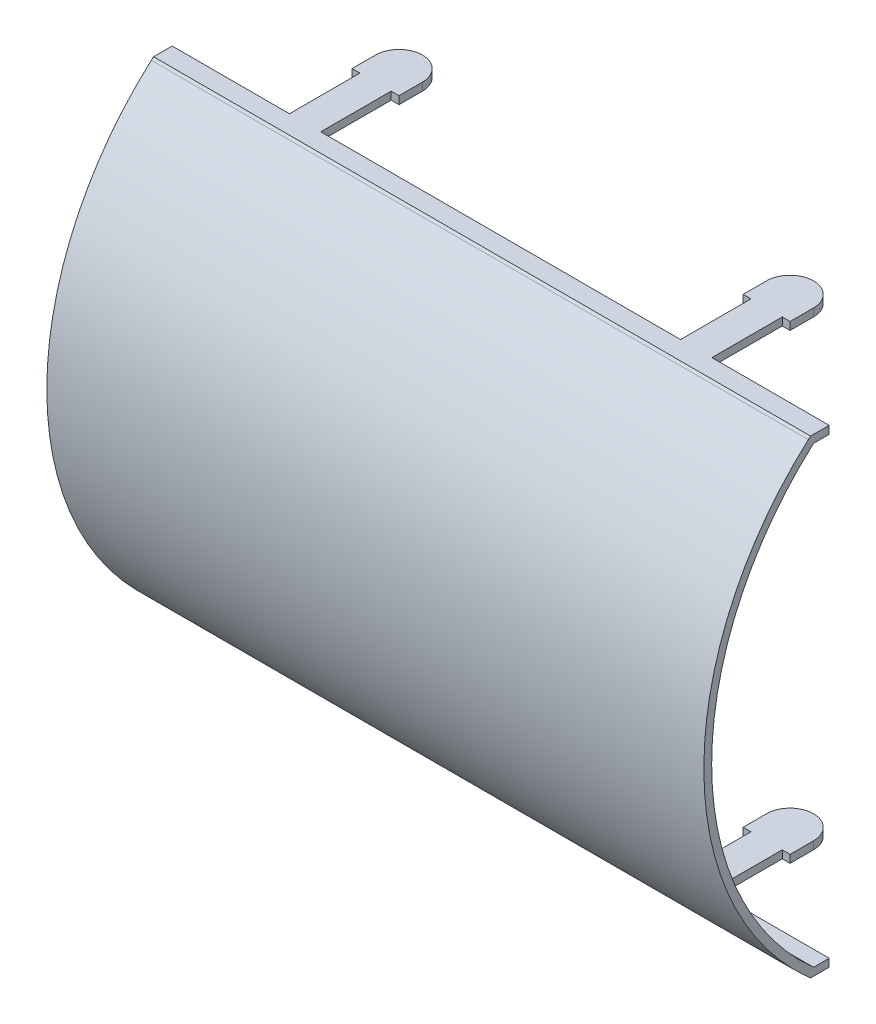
ISO-10303-21;
HEADER;
FILE_DESCRIPTION(('STEP AP214'),'2;1');
FILE_NAME('part.step','',(''),(''),'','','');
FILE_SCHEMA(('AUTOMOTIVE_DESIGN { 1 0 10303 214 1 1 1 1 }'));
ENDSEC;
DATA;
#1=APPLICATION_CONTEXT('core data for automotive mechanical design processes');
#2=APPLICATION_PROTOCOL_DEFINITION('international standard','automotive_design',2000,#1);
#3=PRODUCT_CONTEXT('',#1,'mechanical');
#4=PRODUCT('Part','Part','',(#3));
#5=PRODUCT_RELATED_PRODUCT_CATEGORY('part','',(#4));
#6=PRODUCT_DEFINITION_FORMATION('','',#4);
#7=PRODUCT_DEFINITION_CONTEXT('part definition',#1,'design');
#8=PRODUCT_DEFINITION('design','',#6,#7);
#9=PRODUCT_DEFINITION_SHAPE('','',#8);
#10=(LENGTH_UNIT() NAMED_UNIT(*) SI_UNIT(.MILLI.,.METRE.));
#11=(NAMED_UNIT(*) PLANE_ANGLE_UNIT() SI_UNIT($,.RADIAN.));
#12=(NAMED_UNIT(*) SI_UNIT($,.STERADIAN.) SOLID_ANGLE_UNIT());
#13=UNCERTAINTY_MEASURE_WITH_UNIT(LENGTH_MEASURE(1.E-05),#10,'distance_accuracy_value','');
#14=(GEOMETRIC_REPRESENTATION_CONTEXT(3) GLOBAL_UNCERTAINTY_ASSIGNED_CONTEXT((#13)) GLOBAL_UNIT_ASSIGNED_CONTEXT((#10,
#11,#12)) REPRESENTATION_CONTEXT('',''));
#15=CARTESIAN_POINT('',(0.,0.,0.));
#16=DIRECTION('',(0.,0.,1.));
#17=DIRECTION('',(1.,0.,0.));
#18=AXIS2_PLACEMENT_3D('',#15,#16,#17);
#19=CARTESIAN_POINT('',(11.5,15.00000003,11.8883668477));
#20=DIRECTION('',(0.,0.,1.));
#21=DIRECTION('',(1.,0.,0.));
#22=AXIS2_PLACEMENT_3D('',#19,#20,#21);
#23=PLANE('',#22);
#24=DIRECTION('',(1.,0.,0.));
#25=VECTOR('',#24,1.);
#26=CARTESIAN_POINT('',(0.,-15.,11.8883668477));
#27=LINE('',#26,#25);
#28=CARTESIAN_POINT('',(21.,-15.,11.8883668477));
#29=VERTEX_POINT('',#28);
#30=CARTESIAN_POINT('',(13.5,-15.,11.8883668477));
#31=VERTEX_POINT('',#30);
#32=EDGE_CURVE('E372',#29,#31,#27,.F.);
#33=ORIENTED_EDGE('',*,*,#32,.T.);
#34=DIRECTION('',(0.,1.,0.));
#35=VECTOR('',#34,1.);
#36=CARTESIAN_POINT('',(13.5,15.00000003,11.8883668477));
#37=LINE('',#36,#35);
#38=CARTESIAN_POINT('',(13.5,-14.5,11.8883668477));
#39=VERTEX_POINT('',#38);
#40=EDGE_CURVE('E368',#31,#39,#37,.T.);
#41=ORIENTED_EDGE('',*,*,#40,.T.);
#42=DIRECTION('',(1.,0.,0.));
#43=VECTOR('',#42,1.);
#44=CARTESIAN_POINT('',(0.,-14.5,11.8883668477));
#45=LINE('',#44,#43);
#46=CARTESIAN_POINT('',(21.,-14.5,11.8883668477));
#47=VERTEX_POINT('',#46);
#48=EDGE_CURVE('E276',#47,#39,#45,.F.);
#49=ORIENTED_EDGE('',*,*,#48,.F.);
#50=DIRECTION('',(0.,1.,0.));
#51=VECTOR('',#50,1.);
#52=CARTESIAN_POINT('',(21.,15.00000003,11.8883668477));
#53=LINE('',#52,#51);
#54=EDGE_CURVE('E376',#29,#47,#53,.T.);
#55=ORIENTED_EDGE('',*,*,#54,.F.);
#56=EDGE_LOOP('',(#33,#41,#49,#55));
#57=FACE_BOUND('',#56,.T.);
#58=ADVANCED_FACE('F16',(#57),#23,.F.);
#59=CARTESIAN_POINT('',(13.5,15.00000003,11.8883668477));
#60=DIRECTION('',(-1.,0.,0.));
#61=DIRECTION('',(0.,0.,1.));
#62=AXIS2_PLACEMENT_3D('',#59,#60,#61);
#63=PLANE('',#62);
#64=DIRECTION('',(0.,0.,1.));
#65=VECTOR('',#64,1.);
#66=CARTESIAN_POINT('',(13.5,-15.,13.0784607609));
#67=LINE('',#66,#65);
#68=CARTESIAN_POINT('',(13.5,-15.,7.38836684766));
#69=VERTEX_POINT('',#68);
#70=EDGE_CURVE('E364',#31,#69,#67,.F.);
#71=ORIENTED_EDGE('',*,*,#70,.T.);
#72=DIRECTION('',(0.,1.,0.));
#73=VECTOR('',#72,1.);
#74=CARTESIAN_POINT('',(13.5,15.00000003,7.38836684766));
#75=LINE('',#74,#73);
#76=CARTESIAN_POINT('',(13.5,-14.5,7.38836684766));
#77=VERTEX_POINT('',#76);
#78=EDGE_CURVE('E358',#69,#77,#75,.T.);
#79=ORIENTED_EDGE('',*,*,#78,.T.);
#80=DIRECTION('',(0.,0.,1.));
#81=VECTOR('',#80,1.);
#82=CARTESIAN_POINT('',(13.5,-14.5,12.8883668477));
#83=LINE('',#82,#81);
#84=EDGE_CURVE('E505',#39,#77,#83,.F.);
#85=ORIENTED_EDGE('',*,*,#84,.F.);
#86=ORIENTED_EDGE('',*,*,#40,.F.);
#87=EDGE_LOOP('',(#71,#79,#85,#86));
#88=FACE_BOUND('',#87,.T.);
#89=ADVANCED_FACE('F844',(#88),#63,.F.);
#90=CARTESIAN_POINT('',(11.,15.00000003,7.38836684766));
#91=DIRECTION('',(0.,0.,-1.));
#92=DIRECTION('',(-1.,0.,0.));
#93=AXIS2_PLACEMENT_3D('',#90,#91,#92);
#94=PLANE('',#93);
#95=DIRECTION('',(1.,0.,0.));
#96=VECTOR('',#95,1.);
#97=CARTESIAN_POINT('',(0.,-15.,7.38836684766));
#98=LINE('',#97,#96);
#99=CARTESIAN_POINT('',(14.,-15.,7.38836684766));
#100=VERTEX_POINT('',#99);
#101=EDGE_CURVE('E361',#69,#100,#98,.T.);
#102=ORIENTED_EDGE('',*,*,#101,.T.);
#103=DIRECTION('',(0.,1.,0.));
#104=VECTOR('',#103,1.);
#105=CARTESIAN_POINT('',(14.,15.00000003,7.38836684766));
#106=LINE('',#105,#104);
#107=CARTESIAN_POINT('',(14.,-14.5,7.38836684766));
#108=VERTEX_POINT('',#107);
#109=EDGE_CURVE('E135',#100,#108,#106,.T.);
#110=ORIENTED_EDGE('',*,*,#109,.T.);
#111=DIRECTION('',(1.,0.,0.));
#112=VECTOR('',#111,1.);
#113=CARTESIAN_POINT('',(0.,-14.5,7.38836684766));
#114=LINE('',#113,#112);
#115=EDGE_CURVE('E265',#77,#108,#114,.T.);
#116=ORIENTED_EDGE('',*,*,#115,.F.);
#117=ORIENTED_EDGE('',*,*,#78,.F.);
#118=EDGE_LOOP('',(#102,#110,#116,#117));
#119=FACE_BOUND('',#118,.T.);
#120=ADVANCED_FACE('F836',(#119),#94,.F.);
#121=CARTESIAN_POINT('',(14.,15.00000003,7.38836684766));
#122=DIRECTION('',(-1.,0.,0.));
#123=DIRECTION('',(0.,0.,1.));
#124=AXIS2_PLACEMENT_3D('',#121,#122,#123);
#125=PLANE('',#124);
#126=DIRECTION('',(0.,0.,1.));
#127=VECTOR('',#126,1.);
#128=CARTESIAN_POINT('',(14.,-15.,13.0784607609));
#129=LINE('',#128,#127);
#130=CARTESIAN_POINT('',(14.,-15.,5.88836684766));
#131=VERTEX_POINT('',#130);
#132=EDGE_CURVE('E363',#100,#131,#129,.F.);
#133=ORIENTED_EDGE('',*,*,#132,.T.);
#134=DIRECTION('',(0.,1.,0.));
#135=VECTOR('',#134,1.);
#136=CARTESIAN_POINT('',(14.,-0.659999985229,5.88836684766));
#137=LINE('',#136,#135);
#138=CARTESIAN_POINT('',(14.,-14.5,5.88836684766));
#139=VERTEX_POINT('',#138);
#140=EDGE_CURVE('E124',#139,#131,#137,.F.);
#141=ORIENTED_EDGE('',*,*,#140,.F.);
#142=DIRECTION('',(0.,0.,1.));
#143=VECTOR('',#142,1.);
#144=CARTESIAN_POINT('',(14.,-14.5,12.8883668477));
#145=LINE('',#144,#143);
#146=EDGE_CURVE('E257',#108,#139,#145,.F.);
#147=ORIENTED_EDGE('',*,*,#146,.F.);
#148=ORIENTED_EDGE('',*,*,#109,.F.);
#149=EDGE_LOOP('',(#133,#141,#147,#148));
#150=FACE_BOUND('',#149,.T.);
#151=ADVANCED_FACE('F834',(#150),#125,.F.);
#152=CARTESIAN_POINT('',(12.5,-0.659999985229,5.88836684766));
#153=DIRECTION('',(0.,1.,0.));
#154=DIRECTION('',(0.,0.,1.));
#155=AXIS2_PLACEMENT_3D('',#152,#153,#154);
#156=CYLINDRICAL_SURFACE('',#155,1.5);
#157=CARTESIAN_POINT('',(12.5,-15.,5.88836684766));
#158=DIRECTION('',(0.,1.,0.));
#159=DIRECTION('',(0.,0.,1.));
#160=AXIS2_PLACEMENT_3D('',#157,#158,#159);
#161=CIRCLE('',#160,1.5);
#162=CARTESIAN_POINT('',(11.,-15.,5.88836684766));
#163=VERTEX_POINT('',#162);
#164=EDGE_CURVE('E554',#131,#163,#161,.T.);
#165=ORIENTED_EDGE('',*,*,#164,.T.);
#166=DIRECTION('',(0.,1.,0.));
#167=VECTOR('',#166,1.);
#168=CARTESIAN_POINT('',(11.,15.00000003,5.88836684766));
#169=LINE('',#168,#167);
#170=CARTESIAN_POINT('',(11.,-14.5,5.88836684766));
#171=VERTEX_POINT('',#170);
#172=EDGE_CURVE('E242',#163,#171,#169,.T.);
#173=ORIENTED_EDGE('',*,*,#172,.T.);
#174=CARTESIAN_POINT('',(12.5,-14.5,5.88836684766));
#175=DIRECTION('',(0.,1.,0.));
#176=DIRECTION('',(0.,0.,1.));
#177=AXIS2_PLACEMENT_3D('',#174,#175,#176);
#178=CIRCLE('',#177,1.5);
#179=EDGE_CURVE('E19',#139,#171,#178,.T.);
#180=ORIENTED_EDGE('',*,*,#179,.F.);
#181=ORIENTED_EDGE('',*,*,#140,.T.);
#182=EDGE_LOOP('',(#165,#173,#180,#181));
#183=FACE_BOUND('',#182,.T.);
#184=ADVANCED_FACE('F833',(#183),#156,.T.);
#185=CARTESIAN_POINT('',(11.,15.00000003,5.88836684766));
#186=DIRECTION('',(1.,0.,0.));
#187=DIRECTION('',(0.,0.,-1.));
#188=AXIS2_PLACEMENT_3D('',#185,#186,#187);
#189=PLANE('',#188);
#190=DIRECTION('',(0.,0.,1.));
#191=VECTOR('',#190,1.);
#192=CARTESIAN_POINT('',(11.,-15.,13.0784607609));
#193=LINE('',#192,#191);
#194=CARTESIAN_POINT('',(11.,-15.,7.38836684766));
#195=VERTEX_POINT('',#194);
#196=EDGE_CURVE('E238',#163,#195,#193,.T.);
#197=ORIENTED_EDGE('',*,*,#196,.T.);
#198=DIRECTION('',(0.,1.,0.));
#199=VECTOR('',#198,1.);
#200=CARTESIAN_POINT('',(11.,15.00000003,7.38836684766));
#201=LINE('',#200,#199);
#202=CARTESIAN_POINT('',(11.,-14.5,7.38836684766));
#203=VERTEX_POINT('',#202);
#204=EDGE_CURVE('E230',#195,#203,#201,.T.);
#205=ORIENTED_EDGE('',*,*,#204,.T.);
#206=DIRECTION('',(0.,0.,1.));
#207=VECTOR('',#206,1.);
#208=CARTESIAN_POINT('',(11.,-14.5,12.8883668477));
#209=LINE('',#208,#207);
#210=EDGE_CURVE('E235',#171,#203,#209,.T.);
#211=ORIENTED_EDGE('',*,*,#210,.F.);
#212=ORIENTED_EDGE('',*,*,#172,.F.);
#213=EDGE_LOOP('',(#197,#205,#211,#212));
#214=FACE_BOUND('',#213,.T.);
#215=ADVANCED_FACE('F232',(#214),#189,.F.);
#216=CARTESIAN_POINT('',(11.,15.00000003,7.38836684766));
#217=DIRECTION('',(0.,0.,-1.));
#218=DIRECTION('',(-1.,0.,0.));
#219=AXIS2_PLACEMENT_3D('',#216,#217,#218);
#220=PLANE('',#219);
#221=DIRECTION('',(1.,0.,0.));
#222=VECTOR('',#221,1.);
#223=CARTESIAN_POINT('',(0.,-15.,7.38836684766));
#224=LINE('',#223,#222);
#225=CARTESIAN_POINT('',(11.5,-15.,7.38836684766));
#226=VERTEX_POINT('',#225);
#227=EDGE_CURVE('E344',#195,#226,#224,.T.);
#228=ORIENTED_EDGE('',*,*,#227,.T.);
#229=DIRECTION('',(0.,1.,0.));
#230=VECTOR('',#229,1.);
#231=CARTESIAN_POINT('',(11.5,15.00000003,7.38836684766));
#232=LINE('',#231,#230);
#233=CARTESIAN_POINT('',(11.5,-14.5,7.38836684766));
#234=VERTEX_POINT('',#233);
#235=EDGE_CURVE('E241',#226,#234,#232,.T.);
#236=ORIENTED_EDGE('',*,*,#235,.T.);
#237=DIRECTION('',(1.,0.,0.));
#238=VECTOR('',#237,1.);
#239=CARTESIAN_POINT('',(0.,-14.5,7.38836684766));
#240=LINE('',#239,#238);
#241=EDGE_CURVE('E245',#203,#234,#240,.T.);
#242=ORIENTED_EDGE('',*,*,#241,.F.);
#243=ORIENTED_EDGE('',*,*,#204,.F.);
#244=EDGE_LOOP('',(#228,#236,#242,#243));
#245=FACE_BOUND('',#244,.T.);
#246=ADVANCED_FACE('F246',(#245),#220,.F.);
#247=CARTESIAN_POINT('',(11.5,15.00000003,7.38836684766));
#248=DIRECTION('',(1.,0.,0.));
#249=DIRECTION('',(0.,0.,-1.));
#250=AXIS2_PLACEMENT_3D('',#247,#248,#249);
#251=PLANE('',#250);
#252=DIRECTION('',(0.,0.,1.));
#253=VECTOR('',#252,1.);
#254=CARTESIAN_POINT('',(11.5,-15.,13.0784607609));
#255=LINE('',#254,#253);
#256=CARTESIAN_POINT('',(11.5,-15.,11.8883668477));
#257=VERTEX_POINT('',#256);
#258=EDGE_CURVE('E337',#226,#257,#255,.T.);
#259=ORIENTED_EDGE('',*,*,#258,.T.);
#260=DIRECTION('',(0.,1.,0.));
#261=VECTOR('',#260,1.);
#262=CARTESIAN_POINT('',(11.5,15.00000003,11.8883668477));
#263=LINE('',#262,#261);
#264=CARTESIAN_POINT('',(11.5,-14.5,11.8883668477));
#265=VERTEX_POINT('',#264);
#266=EDGE_CURVE('E333',#257,#265,#263,.T.);
#267=ORIENTED_EDGE('',*,*,#266,.T.);
#268=DIRECTION('',(0.,0.,1.));
#269=VECTOR('',#268,1.);
#270=CARTESIAN_POINT('',(11.5,-14.5,12.8883668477));
#271=LINE('',#270,#269);
#272=EDGE_CURVE('E251',#234,#265,#271,.T.);
#273=ORIENTED_EDGE('',*,*,#272,.F.);
#274=ORIENTED_EDGE('',*,*,#235,.F.);
#275=EDGE_LOOP('',(#259,#267,#273,#274));
#276=FACE_BOUND('',#275,.T.);
#277=ADVANCED_FACE('F828',(#276),#251,.F.);
#278=CARTESIAN_POINT('',(11.5,15.00000003,11.8883668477));
#279=DIRECTION('',(0.,0.,1.));
#280=DIRECTION('',(1.,0.,0.));
#281=AXIS2_PLACEMENT_3D('',#278,#279,#280);
#282=PLANE('',#281);
#283=DIRECTION('',(1.,0.,0.));
#284=VECTOR('',#283,1.);
#285=CARTESIAN_POINT('',(0.,-15.,11.8883668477));
#286=LINE('',#285,#284);
#287=CARTESIAN_POINT('',(-11.5,-15.,11.8883668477));
#288=VERTEX_POINT('',#287);
#289=EDGE_CURVE('E328',#257,#288,#286,.F.);
#290=ORIENTED_EDGE('',*,*,#289,.T.);
#291=DIRECTION('',(0.,1.,0.));
#292=VECTOR('',#291,1.);
#293=CARTESIAN_POINT('',(-11.5,15.00000003,11.8883668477));
#294=LINE('',#293,#292);
#295=CARTESIAN_POINT('',(-11.5,-14.5,11.8883668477));
#296=VERTEX_POINT('',#295);
#297=EDGE_CURVE('E324',#296,#288,#294,.F.);
#298=ORIENTED_EDGE('',*,*,#297,.F.);
#299=DIRECTION('',(1.,0.,0.));
#300=VECTOR('',#299,1.);
#301=CARTESIAN_POINT('',(0.,-14.5,11.8883668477));
#302=LINE('',#301,#300);
#303=EDGE_CURVE('E491',#265,#296,#302,.F.);
#304=ORIENTED_EDGE('',*,*,#303,.F.);
#305=ORIENTED_EDGE('',*,*,#266,.F.);
#306=EDGE_LOOP('',(#290,#298,#304,#305));
#307=FACE_BOUND('',#306,.T.);
#308=ADVANCED_FACE('F825',(#307),#282,.F.);
#309=CARTESIAN_POINT('',(-11.5,15.00000003,7.38836684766));
#310=DIRECTION('',(1.,0.,0.));
#311=DIRECTION('',(0.,0.,-1.));
#312=AXIS2_PLACEMENT_3D('',#309,#310,#311);
#313=PLANE('',#312);
#314=DIRECTION('',(0.,0.,1.));
#315=VECTOR('',#314,1.);
#316=CARTESIAN_POINT('',(-11.5,-15.,13.0784607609));
#317=LINE('',#316,#315);
#318=CARTESIAN_POINT('',(-11.5,-15.,7.38836684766));
#319=VERTEX_POINT('',#318);
#320=EDGE_CURVE('E320',#288,#319,#317,.F.);
#321=ORIENTED_EDGE('',*,*,#320,.T.);
#322=DIRECTION('',(0.,1.,0.));
#323=VECTOR('',#322,1.);
#324=CARTESIAN_POINT('',(-11.5,15.00000003,7.38836684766));
#325=LINE('',#324,#323);
#326=CARTESIAN_POINT('',(-11.5,-14.5,7.38836684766));
#327=VERTEX_POINT('',#326);
#328=EDGE_CURVE('E314',#319,#327,#325,.T.);
#329=ORIENTED_EDGE('',*,*,#328,.T.);
#330=DIRECTION('',(0.,0.,1.));
#331=VECTOR('',#330,1.);
#332=CARTESIAN_POINT('',(-11.5,-14.5,12.8883668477));
#333=LINE('',#332,#331);
#334=EDGE_CURVE('E486',#296,#327,#333,.F.);
#335=ORIENTED_EDGE('',*,*,#334,.F.);
#336=ORIENTED_EDGE('',*,*,#297,.T.);
#337=EDGE_LOOP('',(#321,#329,#335,#336));
#338=FACE_BOUND('',#337,.T.);
#339=ADVANCED_FACE('F821',(#338),#313,.T.);
#340=CARTESIAN_POINT('',(11.,15.00000003,7.38836684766));
#341=DIRECTION('',(0.,0.,-1.));
#342=DIRECTION('',(-1.,0.,0.));
#343=AXIS2_PLACEMENT_3D('',#340,#341,#342);
#344=PLANE('',#343);
#345=DIRECTION('',(1.,0.,0.));
#346=VECTOR('',#345,1.);
#347=CARTESIAN_POINT('',(0.,-15.,7.38836684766));
#348=LINE('',#347,#346);
#349=CARTESIAN_POINT('',(-11.,-15.,7.38836684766));
#350=VERTEX_POINT('',#349);
#351=EDGE_CURVE('E317',#319,#350,#348,.T.);
#352=ORIENTED_EDGE('',*,*,#351,.T.);
#353=DIRECTION('',(0.,1.,0.));
#354=VECTOR('',#353,1.);
#355=CARTESIAN_POINT('',(-11.,15.00000003,7.38836684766));
#356=LINE('',#355,#354);
#357=CARTESIAN_POINT('',(-11.,-14.5,7.38836684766));
#358=VERTEX_POINT('',#357);
#359=EDGE_CURVE('E311',#358,#350,#356,.F.);
#360=ORIENTED_EDGE('',*,*,#359,.F.);
#361=DIRECTION('',(1.,0.,0.));
#362=VECTOR('',#361,1.);
#363=CARTESIAN_POINT('',(0.,-14.5,7.38836684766));
#364=LINE('',#363,#362);
#365=EDGE_CURVE('E482',#327,#358,#364,.T.);
#366=ORIENTED_EDGE('',*,*,#365,.F.);
#367=ORIENTED_EDGE('',*,*,#328,.F.);
#368=EDGE_LOOP('',(#352,#360,#366,#367));
#369=FACE_BOUND('',#368,.T.);
#370=ADVANCED_FACE('F815',(#369),#344,.F.);
#371=CARTESIAN_POINT('',(-11.,15.00000003,5.88836684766));
#372=DIRECTION('',(1.,0.,0.));
#373=DIRECTION('',(0.,0.,-1.));
#374=AXIS2_PLACEMENT_3D('',#371,#372,#373);
#375=PLANE('',#374);
#376=DIRECTION('',(0.,0.,1.));
#377=VECTOR('',#376,1.);
#378=CARTESIAN_POINT('',(-11.,-15.,13.0784607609));
#379=LINE('',#378,#377);
#380=CARTESIAN_POINT('',(-11.,-15.,5.88836684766));
#381=VERTEX_POINT('',#380);
#382=EDGE_CURVE('E319',#350,#381,#379,.F.);
#383=ORIENTED_EDGE('',*,*,#382,.T.);
#384=DIRECTION('',(0.,-1.,0.));
#385=VECTOR('',#384,1.);
#386=CARTESIAN_POINT('',(-11.,-0.659999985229,5.88836684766));
#387=LINE('',#386,#385);
#388=CARTESIAN_POINT('',(-11.,-14.5,5.88836684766));
#389=VERTEX_POINT('',#388);
#390=EDGE_CURVE('E308',#389,#381,#387,.T.);
#391=ORIENTED_EDGE('',*,*,#390,.F.);
#392=DIRECTION('',(0.,0.,1.));
#393=VECTOR('',#392,1.);
#394=CARTESIAN_POINT('',(-11.,-14.5,12.8883668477));
#395=LINE('',#394,#393);
#396=EDGE_CURVE('E485',#358,#389,#395,.F.);
#397=ORIENTED_EDGE('',*,*,#396,.F.);
#398=ORIENTED_EDGE('',*,*,#359,.T.);
#399=EDGE_LOOP('',(#383,#391,#397,#398));
#400=FACE_BOUND('',#399,.T.);
#401=ADVANCED_FACE('F812',(#400),#375,.T.);
#402=CARTESIAN_POINT('',(-12.5,-0.659999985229,5.88836684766));
#403=DIRECTION('',(0.,-1.,0.));
#404=DIRECTION('',(0.,0.,-1.));
#405=AXIS2_PLACEMENT_3D('',#402,#403,#404);
#406=CYLINDRICAL_SURFACE('',#405,1.5);
#407=CARTESIAN_POINT('',(-12.5,-15.,5.88836684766));
#408=DIRECTION('',(0.,-1.,0.));
#409=DIRECTION('',(0.,0.,-1.));
#410=AXIS2_PLACEMENT_3D('',#407,#408,#409);
#411=CIRCLE('',#410,1.5);
#412=CARTESIAN_POINT('',(-14.,-15.,5.88836684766));
#413=VERTEX_POINT('',#412);
#414=EDGE_CURVE('E552',#381,#413,#411,.F.);
#415=ORIENTED_EDGE('',*,*,#414,.T.);
#416=DIRECTION('',(0.,1.,0.));
#417=VECTOR('',#416,1.);
#418=CARTESIAN_POINT('',(-14.,15.00000003,5.88836684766));
#419=LINE('',#418,#417);
#420=CARTESIAN_POINT('',(-14.,-14.5,5.88836684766));
#421=VERTEX_POINT('',#420);
#422=EDGE_CURVE('E303',#421,#413,#419,.F.);
#423=ORIENTED_EDGE('',*,*,#422,.F.);
#424=CARTESIAN_POINT('',(-12.5,-14.5,5.88836684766));
#425=DIRECTION('',(0.,-1.,0.));
#426=DIRECTION('',(0.,0.,-1.));
#427=AXIS2_PLACEMENT_3D('',#424,#425,#426);
#428=CIRCLE('',#427,1.5);
#429=EDGE_CURVE('E559',#389,#421,#428,.F.);
#430=ORIENTED_EDGE('',*,*,#429,.F.);
#431=ORIENTED_EDGE('',*,*,#390,.T.);
#432=EDGE_LOOP('',(#415,#423,#430,#431));
#433=FACE_BOUND('',#432,.T.);
#434=ADVANCED_FACE('F810',(#433),#406,.T.);
#435=CARTESIAN_POINT('',(-14.,15.00000003,7.38836684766));
#436=DIRECTION('',(-1.,0.,0.));
#437=DIRECTION('',(0.,0.,1.));
#438=AXIS2_PLACEMENT_3D('',#435,#436,#437);
#439=PLANE('',#438);
#440=DIRECTION('',(0.,0.,1.));
#441=VECTOR('',#440,1.);
#442=CARTESIAN_POINT('',(-14.,-15.,13.0784607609));
#443=LINE('',#442,#441);
#444=CARTESIAN_POINT('',(-14.,-15.,7.38836684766));
#445=VERTEX_POINT('',#444);
#446=EDGE_CURVE('E299',#413,#445,#443,.T.);
#447=ORIENTED_EDGE('',*,*,#446,.T.);
#448=DIRECTION('',(0.,1.,0.));
#449=VECTOR('',#448,1.);
#450=CARTESIAN_POINT('',(-14.,15.00000003,7.38836684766));
#451=LINE('',#450,#449);
#452=CARTESIAN_POINT('',(-14.,-14.5,7.38836684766));
#453=VERTEX_POINT('',#452);
#454=EDGE_CURVE('E295',#445,#453,#451,.T.);
#455=ORIENTED_EDGE('',*,*,#454,.T.);
#456=DIRECTION('',(0.,0.,1.));
#457=VECTOR('',#456,1.);
#458=CARTESIAN_POINT('',(-14.,-14.5,12.8883668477));
#459=LINE('',#458,#457);
#460=EDGE_CURVE('E479',#421,#453,#459,.T.);
#461=ORIENTED_EDGE('',*,*,#460,.F.);
#462=ORIENTED_EDGE('',*,*,#422,.T.);
#463=EDGE_LOOP('',(#447,#455,#461,#462));
#464=FACE_BOUND('',#463,.T.);
#465=ADVANCED_FACE('F805',(#464),#439,.T.);
#466=CARTESIAN_POINT('',(11.,15.00000003,7.38836684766));
#467=DIRECTION('',(0.,0.,-1.));
#468=DIRECTION('',(-1.,0.,0.));
#469=AXIS2_PLACEMENT_3D('',#466,#467,#468);
#470=PLANE('',#469);
#471=DIRECTION('',(1.,0.,0.));
#472=VECTOR('',#471,1.);
#473=CARTESIAN_POINT('',(0.,-15.,7.38836684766));
#474=LINE('',#473,#472);
#475=CARTESIAN_POINT('',(-13.5,-15.,7.38836684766));
#476=VERTEX_POINT('',#475);
#477=EDGE_CURVE('E290',#445,#476,#474,.T.);
#478=ORIENTED_EDGE('',*,*,#477,.T.);
#479=DIRECTION('',(0.,1.,0.));
#480=VECTOR('',#479,1.);
#481=CARTESIAN_POINT('',(-13.5,15.00000003,7.38836684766));
#482=LINE('',#481,#480);
#483=CARTESIAN_POINT('',(-13.5,-14.5,7.38836684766));
#484=VERTEX_POINT('',#483);
#485=EDGE_CURVE('E281',#484,#476,#482,.F.);
#486=ORIENTED_EDGE('',*,*,#485,.F.);
#487=DIRECTION('',(1.,0.,0.));
#488=VECTOR('',#487,1.);
#489=CARTESIAN_POINT('',(0.,-14.5,7.38836684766));
#490=LINE('',#489,#488);
#491=EDGE_CURVE('E475',#453,#484,#490,.T.);
#492=ORIENTED_EDGE('',*,*,#491,.F.);
#493=ORIENTED_EDGE('',*,*,#454,.F.);
#494=EDGE_LOOP('',(#478,#486,#492,#493));
#495=FACE_BOUND('',#494,.T.);
#496=ADVANCED_FACE('F801',(#495),#470,.F.);
#497=CARTESIAN_POINT('',(-13.5,15.00000003,11.8883668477));
#498=DIRECTION('',(-1.,0.,0.));
#499=DIRECTION('',(0.,0.,1.));
#500=AXIS2_PLACEMENT_3D('',#497,#498,#499);
#501=PLANE('',#500);
#502=DIRECTION('',(0.,0.,1.));
#503=VECTOR('',#502,1.);
#504=CARTESIAN_POINT('',(-13.5,-15.,13.0784607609));
#505=LINE('',#504,#503);
#506=CARTESIAN_POINT('',(-13.5,-15.,11.8883668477));
#507=VERTEX_POINT('',#506);
#508=EDGE_CURVE('E287',#476,#507,#505,.T.);
#509=ORIENTED_EDGE('',*,*,#508,.T.);
#510=DIRECTION('',(0.,1.,0.));
#511=VECTOR('',#510,1.);
#512=CARTESIAN_POINT('',(-13.5,15.00000003,11.8883668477));
#513=LINE('',#512,#511);
#514=CARTESIAN_POINT('',(-13.5,-14.5,11.8883668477));
#515=VERTEX_POINT('',#514);
#516=EDGE_CURVE('E271',#507,#515,#513,.T.);
#517=ORIENTED_EDGE('',*,*,#516,.T.);
#518=DIRECTION('',(0.,0.,1.));
#519=VECTOR('',#518,1.);
#520=CARTESIAN_POINT('',(-13.5,-14.5,12.8883668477));
#521=LINE('',#520,#519);
#522=EDGE_CURVE('E478',#484,#515,#521,.T.);
#523=ORIENTED_EDGE('',*,*,#522,.F.);
#524=ORIENTED_EDGE('',*,*,#485,.T.);
#525=EDGE_LOOP('',(#509,#517,#523,#524));
#526=FACE_BOUND('',#525,.T.);
#527=ADVANCED_FACE('F797',(#526),#501,.T.);
#528=CARTESIAN_POINT('',(11.5,15.00000003,11.8883668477));
#529=DIRECTION('',(0.,0.,1.));
#530=DIRECTION('',(1.,0.,0.));
#531=AXIS2_PLACEMENT_3D('',#528,#529,#530);
#532=PLANE('',#531);
#533=DIRECTION('',(1.,0.,0.));
#534=VECTOR('',#533,1.);
#535=CARTESIAN_POINT('',(0.,-15.,11.8883668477));
#536=LINE('',#535,#534);
#537=CARTESIAN_POINT('',(-21.,-15.,11.8883668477));
#538=VERTEX_POINT('',#537);
#539=EDGE_CURVE('E289',#507,#538,#536,.F.);
#540=ORIENTED_EDGE('',*,*,#539,.T.);
#541=DIRECTION('',(0.,1.,0.));
#542=VECTOR('',#541,1.);
#543=CARTESIAN_POINT('',(-21.,15.00000003,11.8883668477));
#544=LINE('',#543,#542);
#545=CARTESIAN_POINT('',(-21.,-14.5,11.8883668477));
#546=VERTEX_POINT('',#545);
#547=EDGE_CURVE('E279',#546,#538,#544,.F.);
#548=ORIENTED_EDGE('',*,*,#547,.F.);
#549=DIRECTION('',(1.,0.,0.));
#550=VECTOR('',#549,1.);
#551=CARTESIAN_POINT('',(0.,-14.5,11.8883668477));
#552=LINE('',#551,#550);
#553=EDGE_CURVE('E516',#515,#546,#552,.F.);
#554=ORIENTED_EDGE('',*,*,#553,.F.);
#555=ORIENTED_EDGE('',*,*,#516,.F.);
#556=EDGE_LOOP('',(#540,#548,#554,#555));
#557=FACE_BOUND('',#556,.T.);
#558=ADVANCED_FACE('F793',(#557),#532,.F.);
#559=CARTESIAN_POINT('',(0.,-14.5,12.8883668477));
#560=DIRECTION('',(0.,1.,0.));
#561=DIRECTION('',(0.,0.,1.));
#562=AXIS2_PLACEMENT_3D('',#559,#560,#561);
#563=PLANE('',#562);
#564=ORIENTED_EDGE('',*,*,#522,.T.);
#565=ORIENTED_EDGE('',*,*,#553,.T.);
#566=DIRECTION('',(0.,0.,1.));
#567=VECTOR('',#566,1.);
#568=CARTESIAN_POINT('',(-21.,-14.5,12.8883668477));
#569=LINE('',#568,#567);
#570=CARTESIAN_POINT('',(-21.,-14.4999999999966,12.88836684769));
#571=VERTEX_POINT('',#570);
#572=EDGE_CURVE('E268',#546,#571,#569,.T.);
#573=ORIENTED_EDGE('',*,*,#572,.T.);
#574=DIRECTION('',(1.,0.,0.));
#575=VECTOR('',#574,1.);
#576=CARTESIAN_POINT('',(0.,-14.4999999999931,12.8883668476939));
#577=LINE('',#576,#575);
#578=CARTESIAN_POINT('',(21.,-14.4999999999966,12.88836684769));
#579=VERTEX_POINT('',#578);
#580=EDGE_CURVE('E693',#571,#579,#577,.T.);
#581=ORIENTED_EDGE('',*,*,#580,.T.);
#582=DIRECTION('',(0.,0.,1.));
#583=VECTOR('',#582,1.);
#584=CARTESIAN_POINT('',(21.,-14.5,12.8883668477));
#585=LINE('',#584,#583);
#586=EDGE_CURVE('E270',#579,#47,#585,.F.);
#587=ORIENTED_EDGE('',*,*,#586,.T.);
#588=ORIENTED_EDGE('',*,*,#48,.T.);
#589=ORIENTED_EDGE('',*,*,#84,.T.);
#590=ORIENTED_EDGE('',*,*,#115,.T.);
#591=ORIENTED_EDGE('',*,*,#146,.T.);
#592=ORIENTED_EDGE('',*,*,#179,.T.);
#593=ORIENTED_EDGE('',*,*,#210,.T.);
#594=ORIENTED_EDGE('',*,*,#241,.T.);
#595=ORIENTED_EDGE('',*,*,#272,.T.);
#596=ORIENTED_EDGE('',*,*,#303,.T.);
#597=ORIENTED_EDGE('',*,*,#334,.T.);
#598=ORIENTED_EDGE('',*,*,#365,.T.);
#599=ORIENTED_EDGE('',*,*,#396,.T.);
#600=ORIENTED_EDGE('',*,*,#429,.T.);
#601=ORIENTED_EDGE('',*,*,#460,.T.);
#602=ORIENTED_EDGE('',*,*,#491,.T.);
#603=EDGE_LOOP('',(#564,#565,#573,#581,#587,#588,#589,#590,#591,#592,#593,#594,#595,#596,#597,
#598,#599,#600,#601,#602));
#604=FACE_BOUND('',#603,.T.);
#605=ADVANCED_FACE('F254',(#604),#563,.T.);
#606=CARTESIAN_POINT('',(0.,14.50000003,12.8883668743));
#607=DIRECTION('',(0.,1.,0.));
#608=DIRECTION('',(0.,0.,1.));
#609=AXIS2_PLACEMENT_3D('',#606,#607,#608);
#610=PLANE('',#609);
#611=DIRECTION('',(0.,0.,1.));
#612=VECTOR('',#611,1.);
#613=CARTESIAN_POINT('',(-13.5,14.50000003,11.8883668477));
#614=LINE('',#613,#612);
#615=CARTESIAN_POINT('',(-13.5,14.50000003,7.38836684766));
#616=VERTEX_POINT('',#615);
#617=CARTESIAN_POINT('',(-13.5,14.50000003,11.8883668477));
#618=VERTEX_POINT('',#617);
#619=EDGE_CURVE('E390',#616,#618,#614,.T.);
#620=ORIENTED_EDGE('',*,*,#619,.F.);
#621=DIRECTION('',(-1.,0.,0.));
#622=VECTOR('',#621,1.);
#623=CARTESIAN_POINT('',(11.,14.50000003,7.38836684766));
#624=LINE('',#623,#622);
#625=CARTESIAN_POINT('',(-14.,14.50000003,7.38836684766));
#626=VERTEX_POINT('',#625);
#627=EDGE_CURVE('E396',#616,#626,#624,.T.);
#628=ORIENTED_EDGE('',*,*,#627,.T.);
#629=DIRECTION('',(0.,0.,1.));
#630=VECTOR('',#629,1.);
#631=CARTESIAN_POINT('',(-14.,14.50000003,7.38836684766));
#632=LINE('',#631,#630);
#633=CARTESIAN_POINT('',(-14.,14.50000003,5.88836684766));
#634=VERTEX_POINT('',#633);
#635=EDGE_CURVE('E402',#634,#626,#632,.T.);
#636=ORIENTED_EDGE('',*,*,#635,.F.);
#637=CARTESIAN_POINT('',(-12.5,14.50000003,5.88836684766));
#638=DIRECTION('',(0.,-1.,0.));
#639=DIRECTION('',(0.,0.,-1.));
#640=AXIS2_PLACEMENT_3D('',#637,#638,#639);
#641=CIRCLE('',#640,1.5);
#642=CARTESIAN_POINT('',(-11.,14.50000003,5.88836684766));
#643=VERTEX_POINT('',#642);
#644=EDGE_CURVE('E556',#643,#634,#641,.F.);
#645=ORIENTED_EDGE('',*,*,#644,.F.);
#646=DIRECTION('',(0.,0.,-1.));
#647=VECTOR('',#646,1.);
#648=CARTESIAN_POINT('',(-11.,14.50000003,5.88836684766));
#649=LINE('',#648,#647);
#650=CARTESIAN_POINT('',(-11.,14.50000003,7.38836684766));
#651=VERTEX_POINT('',#650);
#652=EDGE_CURVE('E408',#651,#643,#649,.T.);
#653=ORIENTED_EDGE('',*,*,#652,.F.);
#654=DIRECTION('',(-1.,0.,0.));
#655=VECTOR('',#654,1.);
#656=CARTESIAN_POINT('',(11.,14.50000003,7.38836684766));
#657=LINE('',#656,#655);
#658=CARTESIAN_POINT('',(-11.5,14.50000003,7.38836684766));
#659=VERTEX_POINT('',#658);
#660=EDGE_CURVE('E414',#651,#659,#657,.T.);
#661=ORIENTED_EDGE('',*,*,#660,.T.);
#662=DIRECTION('',(0.,0.,-1.));
#663=VECTOR('',#662,1.);
#664=CARTESIAN_POINT('',(-11.5,14.50000003,7.38836684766));
#665=LINE('',#664,#663);
#666=CARTESIAN_POINT('',(-11.5,14.50000003,11.8883668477));
#667=VERTEX_POINT('',#666);
#668=EDGE_CURVE('E420',#667,#659,#665,.T.);
#669=ORIENTED_EDGE('',*,*,#668,.F.);
#670=DIRECTION('',(1.,0.,0.));
#671=VECTOR('',#670,1.);
#672=CARTESIAN_POINT('',(11.5,14.50000003,11.8883668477));
#673=LINE('',#672,#671);
#674=CARTESIAN_POINT('',(11.5,14.50000003,11.8883668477));
#675=VERTEX_POINT('',#674);
#676=EDGE_CURVE('E426',#667,#675,#673,.T.);
#677=ORIENTED_EDGE('',*,*,#676,.T.);
#678=DIRECTION('',(0.,0.,-1.));
#679=VECTOR('',#678,1.);
#680=CARTESIAN_POINT('',(11.5,14.50000003,7.38836684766));
#681=LINE('',#680,#679);
#682=CARTESIAN_POINT('',(11.5,14.50000003,7.38836684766));
#683=VERTEX_POINT('',#682);
#684=EDGE_CURVE('E430',#675,#683,#681,.T.);
#685=ORIENTED_EDGE('',*,*,#684,.T.);
#686=DIRECTION('',(-1.,0.,0.));
#687=VECTOR('',#686,1.);
#688=CARTESIAN_POINT('',(11.,14.50000003,7.38836684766));
#689=LINE('',#688,#687);
#690=CARTESIAN_POINT('',(11.,14.50000003,7.38836684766));
#691=VERTEX_POINT('',#690);
#692=EDGE_CURVE('E438',#683,#691,#689,.T.);
#693=ORIENTED_EDGE('',*,*,#692,.T.);
#694=DIRECTION('',(0.,0.,-1.));
#695=VECTOR('',#694,1.);
#696=CARTESIAN_POINT('',(11.,14.50000003,5.88836684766));
#697=LINE('',#696,#695);
#698=CARTESIAN_POINT('',(11.,14.50000003,5.88836684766));
#699=VERTEX_POINT('',#698);
#700=EDGE_CURVE('E444',#691,#699,#697,.T.);
#701=ORIENTED_EDGE('',*,*,#700,.T.);
#702=CARTESIAN_POINT('',(12.5,14.50000003,5.88836684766));
#703=DIRECTION('',(0.,1.,0.));
#704=DIRECTION('',(0.,0.,1.));
#705=AXIS2_PLACEMENT_3D('',#702,#703,#704);
#706=CIRCLE('',#705,1.5);
#707=CARTESIAN_POINT('',(14.,14.50000003,5.88836684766));
#708=VERTEX_POINT('',#707);
#709=EDGE_CURVE('E558',#708,#699,#706,.T.);
#710=ORIENTED_EDGE('',*,*,#709,.F.);
#711=DIRECTION('',(0.,0.,1.));
#712=VECTOR('',#711,1.);
#713=CARTESIAN_POINT('',(14.,14.50000003,7.38836684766));
#714=LINE('',#713,#712);
#715=CARTESIAN_POINT('',(14.,14.50000003,7.38836684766));
#716=VERTEX_POINT('',#715);
#717=EDGE_CURVE('E450',#708,#716,#714,.T.);
#718=ORIENTED_EDGE('',*,*,#717,.T.);
#719=DIRECTION('',(-1.,0.,0.));
#720=VECTOR('',#719,1.);
#721=CARTESIAN_POINT('',(11.,14.50000003,7.38836684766));
#722=LINE('',#721,#720);
#723=CARTESIAN_POINT('',(13.5,14.50000003,7.38836684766));
#724=VERTEX_POINT('',#723);
#725=EDGE_CURVE('E457',#716,#724,#722,.T.);
#726=ORIENTED_EDGE('',*,*,#725,.T.);
#727=DIRECTION('',(0.,0.,1.));
#728=VECTOR('',#727,1.);
#729=CARTESIAN_POINT('',(13.5,14.50000003,11.8883668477));
#730=LINE('',#729,#728);
#731=CARTESIAN_POINT('',(13.5,14.50000003,11.8883668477));
#732=VERTEX_POINT('',#731);
#733=EDGE_CURVE('E463',#724,#732,#730,.T.);
#734=ORIENTED_EDGE('',*,*,#733,.T.);
#735=DIRECTION('',(1.,0.,0.));
#736=VECTOR('',#735,1.);
#737=CARTESIAN_POINT('',(11.5,14.50000003,11.8883668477));
#738=LINE('',#737,#736);
#739=CARTESIAN_POINT('',(21.,14.50000003,11.8883668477));
#740=VERTEX_POINT('',#739);
#741=EDGE_CURVE('E469',#732,#740,#738,.T.);
#742=ORIENTED_EDGE('',*,*,#741,.T.);
#743=DIRECTION('',(0.,0.,1.));
#744=VECTOR('',#743,1.);
#745=CARTESIAN_POINT('',(21.,14.50000003,12.8883668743));
#746=LINE('',#745,#744);
#747=CARTESIAN_POINT('',(21.,14.5000000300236,12.8883668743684));
#748=VERTEX_POINT('',#747);
#749=EDGE_CURVE('E572',#748,#740,#746,.F.);
#750=ORIENTED_EDGE('',*,*,#749,.F.);
#751=DIRECTION('',(1.,0.,0.));
#752=VECTOR('',#751,1.);
#753=CARTESIAN_POINT('',(0.,14.5000000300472,12.8883668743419));
#754=LINE('',#753,#752);
#755=CARTESIAN_POINT('',(-21.,14.5000000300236,12.8883668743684));
#756=VERTEX_POINT('',#755);
#757=EDGE_CURVE('E715',#748,#756,#754,.F.);
#758=ORIENTED_EDGE('',*,*,#757,.T.);
#759=DIRECTION('',(0.,0.,1.));
#760=VECTOR('',#759,1.);
#761=CARTESIAN_POINT('',(-21.,14.50000003,12.8883668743));
#762=LINE('',#761,#760);
#763=CARTESIAN_POINT('',(-21.,14.50000003,11.8883668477));
#764=VERTEX_POINT('',#763);
#765=EDGE_CURVE('E519',#764,#756,#762,.T.);
#766=ORIENTED_EDGE('',*,*,#765,.F.);
#767=DIRECTION('',(1.,0.,0.));
#768=VECTOR('',#767,1.);
#769=CARTESIAN_POINT('',(11.5,14.50000003,11.8883668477));
#770=LINE('',#769,#768);
#771=EDGE_CURVE('E385',#764,#618,#770,.T.);
#772=ORIENTED_EDGE('',*,*,#771,.T.);
#773=EDGE_LOOP('',(#620,#628,#636,#645,#653,#661,#669,#677,#685,#693,#701,#710,#718,#726,#734,
#742,#750,#758,#766,#772));
#774=FACE_BOUND('',#773,.T.);
#775=ADVANCED_FACE('F940',(#774),#610,.F.);
#776=CARTESIAN_POINT('',(11.5,15.00000003,11.8883668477));
#777=DIRECTION('',(0.,0.,1.));
#778=DIRECTION('',(1.,0.,0.));
#779=AXIS2_PLACEMENT_3D('',#776,#777,#778);
#780=PLANE('',#779);
#781=DIRECTION('',(0.,1.,0.));
#782=VECTOR('',#781,1.);
#783=CARTESIAN_POINT('',(13.5,15.00000003,11.8883668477));
#784=LINE('',#783,#782);
#785=CARTESIAN_POINT('',(13.5,15.00000003,11.8883668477));
#786=VERTEX_POINT('',#785);
#787=EDGE_CURVE('E466',#732,#786,#784,.T.);
#788=ORIENTED_EDGE('',*,*,#787,.T.);
#789=DIRECTION('',(1.,0.,0.));
#790=VECTOR('',#789,1.);
#791=CARTESIAN_POINT('',(0.,15.00000003,11.8883668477));
#792=LINE('',#791,#790);
#793=CARTESIAN_POINT('',(21.,15.00000003,11.8883668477));
#794=VERTEX_POINT('',#793);
#795=EDGE_CURVE('E591',#794,#786,#792,.F.);
#796=ORIENTED_EDGE('',*,*,#795,.F.);
#797=DIRECTION('',(0.,1.,0.));
#798=VECTOR('',#797,1.);
#799=CARTESIAN_POINT('',(21.,15.00000003,11.8883668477));
#800=LINE('',#799,#798);
#801=EDGE_CURVE('E472',#740,#794,#800,.T.);
#802=ORIENTED_EDGE('',*,*,#801,.F.);
#803=ORIENTED_EDGE('',*,*,#741,.F.);
#804=EDGE_LOOP('',(#788,#796,#802,#803));
#805=FACE_BOUND('',#804,.T.);
#806=ADVANCED_FACE('F936',(#805),#780,.F.);
#807=CARTESIAN_POINT('',(13.5,15.00000003,11.8883668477));
#808=DIRECTION('',(-1.,0.,0.));
#809=DIRECTION('',(0.,0.,1.));
#810=AXIS2_PLACEMENT_3D('',#807,#808,#809);
#811=PLANE('',#810);
#812=DIRECTION('',(0.,1.,0.));
#813=VECTOR('',#812,1.);
#814=CARTESIAN_POINT('',(13.5,15.00000003,7.38836684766));
#815=LINE('',#814,#813);
#816=CARTESIAN_POINT('',(13.5,15.00000003,7.38836684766));
#817=VERTEX_POINT('',#816);
#818=EDGE_CURVE('E460',#724,#817,#815,.T.);
#819=ORIENTED_EDGE('',*,*,#818,.T.);
#820=DIRECTION('',(0.,0.,1.));
#821=VECTOR('',#820,1.);
#822=CARTESIAN_POINT('',(13.5,15.00000003,13.0784607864));
#823=LINE('',#822,#821);
#824=EDGE_CURVE('E587',#786,#817,#823,.F.);
#825=ORIENTED_EDGE('',*,*,#824,.F.);
#826=ORIENTED_EDGE('',*,*,#787,.F.);
#827=ORIENTED_EDGE('',*,*,#733,.F.);
#828=EDGE_LOOP('',(#819,#825,#826,#827));
#829=FACE_BOUND('',#828,.T.);
#830=ADVANCED_FACE('F932',(#829),#811,.F.);
#831=CARTESIAN_POINT('',(11.,15.00000003,7.38836684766));
#832=DIRECTION('',(0.,0.,-1.));
#833=DIRECTION('',(-1.,0.,0.));
#834=AXIS2_PLACEMENT_3D('',#831,#832,#833);
#835=PLANE('',#834);
#836=DIRECTION('',(0.,1.,0.));
#837=VECTOR('',#836,1.);
#838=CARTESIAN_POINT('',(14.,15.00000003,7.38836684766));
#839=LINE('',#838,#837);
#840=CARTESIAN_POINT('',(14.,15.00000003,7.38836684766));
#841=VERTEX_POINT('',#840);
#842=EDGE_CURVE('E454',#716,#841,#839,.T.);
#843=ORIENTED_EDGE('',*,*,#842,.T.);
#844=DIRECTION('',(1.,0.,0.));
#845=VECTOR('',#844,1.);
#846=CARTESIAN_POINT('',(0.,15.00000003,7.38836684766));
#847=LINE('',#846,#845);
#848=EDGE_CURVE('E590',#817,#841,#847,.T.);
#849=ORIENTED_EDGE('',*,*,#848,.F.);
#850=ORIENTED_EDGE('',*,*,#818,.F.);
#851=ORIENTED_EDGE('',*,*,#725,.F.);
#852=EDGE_LOOP('',(#843,#849,#850,#851));
#853=FACE_BOUND('',#852,.T.);
#854=ADVANCED_FACE('F928',(#853),#835,.F.);
#855=CARTESIAN_POINT('',(14.,15.00000003,7.38836684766));
#856=DIRECTION('',(-1.,0.,0.));
#857=DIRECTION('',(0.,0.,1.));
#858=AXIS2_PLACEMENT_3D('',#855,#856,#857);
#859=PLANE('',#858);
#860=DIRECTION('',(0.,1.,0.));
#861=VECTOR('',#860,1.);
#862=CARTESIAN_POINT('',(14.,-0.659999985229,5.88836684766));
#863=LINE('',#862,#861);
#864=CARTESIAN_POINT('',(14.,15.00000003,5.88836684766));
#865=VERTEX_POINT('',#864);
#866=EDGE_CURVE('E453',#865,#708,#863,.F.);
#867=ORIENTED_EDGE('',*,*,#866,.F.);
#868=DIRECTION('',(0.,0.,1.));
#869=VECTOR('',#868,1.);
#870=CARTESIAN_POINT('',(14.,15.00000003,13.0784607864));
#871=LINE('',#870,#869);
#872=EDGE_CURVE('E551',#841,#865,#871,.F.);
#873=ORIENTED_EDGE('',*,*,#872,.F.);
#874=ORIENTED_EDGE('',*,*,#842,.F.);
#875=ORIENTED_EDGE('',*,*,#717,.F.);
#876=EDGE_LOOP('',(#867,#873,#874,#875));
#877=FACE_BOUND('',#876,.T.);
#878=ADVANCED_FACE('F924',(#877),#859,.F.);
#879=CARTESIAN_POINT('',(12.5,-0.659999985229,5.88836684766));
#880=DIRECTION('',(0.,1.,0.));
#881=DIRECTION('',(0.,0.,1.));
#882=AXIS2_PLACEMENT_3D('',#879,#880,#881);
#883=CYLINDRICAL_SURFACE('',#882,1.5);
#884=ORIENTED_EDGE('',*,*,#866,.T.);
#885=ORIENTED_EDGE('',*,*,#709,.T.);
#886=DIRECTION('',(0.,1.,0.));
#887=VECTOR('',#886,1.);
#888=CARTESIAN_POINT('',(11.,15.00000003,5.88836684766));
#889=LINE('',#888,#887);
#890=CARTESIAN_POINT('',(11.,15.00000003,5.88836684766));
#891=VERTEX_POINT('',#890);
#892=EDGE_CURVE('E447',#699,#891,#889,.T.);
#893=ORIENTED_EDGE('',*,*,#892,.T.);
#894=CARTESIAN_POINT('',(12.5,15.00000003,5.88836684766));
#895=DIRECTION('',(0.,1.,0.));
#896=DIRECTION('',(0.,0.,1.));
#897=AXIS2_PLACEMENT_3D('',#894,#895,#896);
#898=CIRCLE('',#897,1.5);
#899=EDGE_CURVE('E547',#865,#891,#898,.T.);
#900=ORIENTED_EDGE('',*,*,#899,.F.);
#901=EDGE_LOOP('',(#884,#885,#893,#900));
#902=FACE_BOUND('',#901,.T.);
#903=ADVANCED_FACE('F920',(#902),#883,.T.);
#904=CARTESIAN_POINT('',(11.,15.00000003,5.88836684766));
#905=DIRECTION('',(1.,0.,0.));
#906=DIRECTION('',(0.,0.,-1.));
#907=AXIS2_PLACEMENT_3D('',#904,#905,#906);
#908=PLANE('',#907);
#909=DIRECTION('',(0.,1.,0.));
#910=VECTOR('',#909,1.);
#911=CARTESIAN_POINT('',(11.,15.00000003,7.38836684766));
#912=LINE('',#911,#910);
#913=CARTESIAN_POINT('',(11.,15.00000003,7.38836684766));
#914=VERTEX_POINT('',#913);
#915=EDGE_CURVE('E441',#691,#914,#912,.T.);
#916=ORIENTED_EDGE('',*,*,#915,.T.);
#917=DIRECTION('',(0.,0.,1.));
#918=VECTOR('',#917,1.);
#919=CARTESIAN_POINT('',(11.,15.00000003,13.0784607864));
#920=LINE('',#919,#918);
#921=EDGE_CURVE('E550',#891,#914,#920,.T.);
#922=ORIENTED_EDGE('',*,*,#921,.F.);
#923=ORIENTED_EDGE('',*,*,#892,.F.);
#924=ORIENTED_EDGE('',*,*,#700,.F.);
#925=EDGE_LOOP('',(#916,#922,#923,#924));
#926=FACE_BOUND('',#925,.T.);
#927=ADVANCED_FACE('F916',(#926),#908,.F.);
#928=CARTESIAN_POINT('',(11.,15.00000003,7.38836684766));
#929=DIRECTION('',(0.,0.,-1.));
#930=DIRECTION('',(-1.,0.,0.));
#931=AXIS2_PLACEMENT_3D('',#928,#929,#930);
#932=PLANE('',#931);
#933=DIRECTION('',(0.,1.,0.));
#934=VECTOR('',#933,1.);
#935=CARTESIAN_POINT('',(11.5,15.00000003,7.38836684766));
#936=LINE('',#935,#934);
#937=CARTESIAN_POINT('',(11.5,15.00000003,7.38836684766));
#938=VERTEX_POINT('',#937);
#939=EDGE_CURVE('E435',#683,#938,#936,.T.);
#940=ORIENTED_EDGE('',*,*,#939,.T.);
#941=DIRECTION('',(1.,0.,0.));
#942=VECTOR('',#941,1.);
#943=CARTESIAN_POINT('',(0.,15.00000003,7.38836684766));
#944=LINE('',#943,#942);
#945=EDGE_CURVE('E613',#914,#938,#944,.T.);
#946=ORIENTED_EDGE('',*,*,#945,.F.);
#947=ORIENTED_EDGE('',*,*,#915,.F.);
#948=ORIENTED_EDGE('',*,*,#692,.F.);
#949=EDGE_LOOP('',(#940,#946,#947,#948));
#950=FACE_BOUND('',#949,.T.);
#951=ADVANCED_FACE('F912',(#950),#932,.F.);
#952=CARTESIAN_POINT('',(11.5,15.00000003,7.38836684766));
#953=DIRECTION('',(1.,0.,0.));
#954=DIRECTION('',(0.,0.,-1.));
#955=AXIS2_PLACEMENT_3D('',#952,#953,#954);
#956=PLANE('',#955);
#957=DIRECTION('',(0.,1.,0.));
#958=VECTOR('',#957,1.);
#959=CARTESIAN_POINT('',(11.5,15.00000003,11.8883668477));
#960=LINE('',#959,#958);
#961=CARTESIAN_POINT('',(11.5,15.00000003,11.8883668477));
#962=VERTEX_POINT('',#961);
#963=EDGE_CURVE('E429',#675,#962,#960,.T.);
#964=ORIENTED_EDGE('',*,*,#963,.T.);
#965=DIRECTION('',(0.,0.,1.));
#966=VECTOR('',#965,1.);
#967=CARTESIAN_POINT('',(11.5,15.00000003,13.0784607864));
#968=LINE('',#967,#966);
#969=EDGE_CURVE('E616',#938,#962,#968,.T.);
#970=ORIENTED_EDGE('',*,*,#969,.F.);
#971=ORIENTED_EDGE('',*,*,#939,.F.);
#972=ORIENTED_EDGE('',*,*,#684,.F.);
#973=EDGE_LOOP('',(#964,#970,#971,#972));
#974=FACE_BOUND('',#973,.T.);
#975=ADVANCED_FACE('F908',(#974),#956,.F.);
#976=CARTESIAN_POINT('',(11.5,15.00000003,11.8883668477));
#977=DIRECTION('',(0.,0.,1.));
#978=DIRECTION('',(1.,0.,0.));
#979=AXIS2_PLACEMENT_3D('',#976,#977,#978);
#980=PLANE('',#979);
#981=ORIENTED_EDGE('',*,*,#676,.F.);
#982=DIRECTION('',(0.,1.,0.));
#983=VECTOR('',#982,1.);
#984=CARTESIAN_POINT('',(-11.5,15.00000003,11.8883668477));
#985=LINE('',#984,#983);
#986=CARTESIAN_POINT('',(-11.5,15.00000003,11.8883668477));
#987=VERTEX_POINT('',#986);
#988=EDGE_CURVE('E423',#987,#667,#985,.F.);
#989=ORIENTED_EDGE('',*,*,#988,.F.);
#990=DIRECTION('',(1.,0.,0.));
#991=VECTOR('',#990,1.);
#992=CARTESIAN_POINT('',(0.,15.00000003,11.8883668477));
#993=LINE('',#992,#991);
#994=EDGE_CURVE('E625',#962,#987,#993,.F.);
#995=ORIENTED_EDGE('',*,*,#994,.F.);
#996=ORIENTED_EDGE('',*,*,#963,.F.);
#997=EDGE_LOOP('',(#981,#989,#995,#996));
#998=FACE_BOUND('',#997,.T.);
#999=ADVANCED_FACE('F904',(#998),#980,.F.);
#1000=CARTESIAN_POINT('',(-11.5,15.00000003,7.38836684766));
#1001=DIRECTION('',(1.,0.,0.));
#1002=DIRECTION('',(0.,0.,-1.));
#1003=AXIS2_PLACEMENT_3D('',#1000,#1001,#1002);
#1004=PLANE('',#1003);
#1005=ORIENTED_EDGE('',*,*,#988,.T.);
#1006=ORIENTED_EDGE('',*,*,#668,.T.);
#1007=DIRECTION('',(0.,1.,0.));
#1008=VECTOR('',#1007,1.);
#1009=CARTESIAN_POINT('',(-11.5,15.00000003,7.38836684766));
#1010=LINE('',#1009,#1008);
#1011=CARTESIAN_POINT('',(-11.5,15.00000003,7.38836684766));
#1012=VERTEX_POINT('',#1011);
#1013=EDGE_CURVE('E417',#659,#1012,#1010,.T.);
#1014=ORIENTED_EDGE('',*,*,#1013,.T.);
#1015=DIRECTION('',(0.,0.,1.));
#1016=VECTOR('',#1015,1.);
#1017=CARTESIAN_POINT('',(-11.5,15.00000003,13.0784607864));
#1018=LINE('',#1017,#1016);
#1019=EDGE_CURVE('E634',#987,#1012,#1018,.F.);
#1020=ORIENTED_EDGE('',*,*,#1019,.F.);
#1021=EDGE_LOOP('',(#1005,#1006,#1014,#1020));
#1022=FACE_BOUND('',#1021,.T.);
#1023=ADVANCED_FACE('F900',(#1022),#1004,.T.);
#1024=CARTESIAN_POINT('',(11.,15.00000003,7.38836684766));
#1025=DIRECTION('',(0.,0.,-1.));
#1026=DIRECTION('',(-1.,0.,0.));
#1027=AXIS2_PLACEMENT_3D('',#1024,#1025,#1026);
#1028=PLANE('',#1027);
#1029=DIRECTION('',(0.,1.,0.));
#1030=VECTOR('',#1029,1.);
#1031=CARTESIAN_POINT('',(-11.,15.00000003,7.38836684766));
#1032=LINE('',#1031,#1030);
#1033=CARTESIAN_POINT('',(-11.,15.00000003,7.38836684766));
#1034=VERTEX_POINT('',#1033);
#1035=EDGE_CURVE('E411',#1034,#651,#1032,.F.);
#1036=ORIENTED_EDGE('',*,*,#1035,.F.);
#1037=DIRECTION('',(1.,0.,0.));
#1038=VECTOR('',#1037,1.);
#1039=CARTESIAN_POINT('',(0.,15.00000003,7.38836684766));
#1040=LINE('',#1039,#1038);
#1041=EDGE_CURVE('E643',#1012,#1034,#1040,.T.);
#1042=ORIENTED_EDGE('',*,*,#1041,.F.);
#1043=ORIENTED_EDGE('',*,*,#1013,.F.);
#1044=ORIENTED_EDGE('',*,*,#660,.F.);
#1045=EDGE_LOOP('',(#1036,#1042,#1043,#1044));
#1046=FACE_BOUND('',#1045,.T.);
#1047=ADVANCED_FACE('F896',(#1046),#1028,.F.);
#1048=CARTESIAN_POINT('',(-11.,15.00000003,5.88836684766));
#1049=DIRECTION('',(1.,0.,0.));
#1050=DIRECTION('',(0.,0.,-1.));
#1051=AXIS2_PLACEMENT_3D('',#1048,#1049,#1050);
#1052=PLANE('',#1051);
#1053=ORIENTED_EDGE('',*,*,#1035,.T.);
#1054=ORIENTED_EDGE('',*,*,#652,.T.);
#1055=DIRECTION('',(0.,-1.,0.));
#1056=VECTOR('',#1055,1.);
#1057=CARTESIAN_POINT('',(-11.,-0.659999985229,5.88836684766));
#1058=LINE('',#1057,#1056);
#1059=CARTESIAN_POINT('',(-11.,15.00000003,5.88836684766));
#1060=VERTEX_POINT('',#1059);
#1061=EDGE_CURVE('E410',#1060,#643,#1058,.T.);
#1062=ORIENTED_EDGE('',*,*,#1061,.F.);
#1063=DIRECTION('',(0.,0.,1.));
#1064=VECTOR('',#1063,1.);
#1065=CARTESIAN_POINT('',(-11.,15.00000003,13.0784607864));
#1066=LINE('',#1065,#1064);
#1067=EDGE_CURVE('E546',#1034,#1060,#1066,.F.);
#1068=ORIENTED_EDGE('',*,*,#1067,.F.);
#1069=EDGE_LOOP('',(#1053,#1054,#1062,#1068));
#1070=FACE_BOUND('',#1069,.T.);
#1071=ADVANCED_FACE('F892',(#1070),#1052,.T.);
#1072=CARTESIAN_POINT('',(-12.5,-0.659999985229,5.88836684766));
#1073=DIRECTION('',(0.,-1.,0.));
#1074=DIRECTION('',(0.,0.,-1.));
#1075=AXIS2_PLACEMENT_3D('',#1072,#1073,#1074);
#1076=CYLINDRICAL_SURFACE('',#1075,1.5);
#1077=ORIENTED_EDGE('',*,*,#1061,.T.);
#1078=ORIENTED_EDGE('',*,*,#644,.T.);
#1079=DIRECTION('',(0.,1.,0.));
#1080=VECTOR('',#1079,1.);
#1081=CARTESIAN_POINT('',(-14.,15.00000003,5.88836684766));
#1082=LINE('',#1081,#1080);
#1083=CARTESIAN_POINT('',(-14.,15.00000003,5.88836684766));
#1084=VERTEX_POINT('',#1083);
#1085=EDGE_CURVE('E405',#1084,#634,#1082,.F.);
#1086=ORIENTED_EDGE('',*,*,#1085,.F.);
#1087=CARTESIAN_POINT('',(-12.5,15.00000003,5.88836684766));
#1088=DIRECTION('',(0.,-1.,0.));
#1089=DIRECTION('',(0.,0.,-1.));
#1090=AXIS2_PLACEMENT_3D('',#1087,#1088,#1089);
#1091=CIRCLE('',#1090,1.5);
#1092=EDGE_CURVE('E542',#1060,#1084,#1091,.F.);
#1093=ORIENTED_EDGE('',*,*,#1092,.F.);
#1094=EDGE_LOOP('',(#1077,#1078,#1086,#1093));
#1095=FACE_BOUND('',#1094,.T.);
#1096=ADVANCED_FACE('F888',(#1095),#1076,.T.);
#1097=CARTESIAN_POINT('',(-14.,15.00000003,7.38836684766));
#1098=DIRECTION('',(-1.,0.,0.));
#1099=DIRECTION('',(0.,0.,1.));
#1100=AXIS2_PLACEMENT_3D('',#1097,#1098,#1099);
#1101=PLANE('',#1100);
#1102=ORIENTED_EDGE('',*,*,#1085,.T.);
#1103=ORIENTED_EDGE('',*,*,#635,.T.);
#1104=DIRECTION('',(0.,1.,0.));
#1105=VECTOR('',#1104,1.);
#1106=CARTESIAN_POINT('',(-14.,15.00000003,7.38836684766));
#1107=LINE('',#1106,#1105);
#1108=CARTESIAN_POINT('',(-14.,15.00000003,7.38836684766));
#1109=VERTEX_POINT('',#1108);
#1110=EDGE_CURVE('E399',#626,#1109,#1107,.T.);
#1111=ORIENTED_EDGE('',*,*,#1110,.T.);
#1112=DIRECTION('',(0.,0.,1.));
#1113=VECTOR('',#1112,1.);
#1114=CARTESIAN_POINT('',(-14.,15.00000003,13.0784607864));
#1115=LINE('',#1114,#1113);
#1116=EDGE_CURVE('E545',#1084,#1109,#1115,.T.);
#1117=ORIENTED_EDGE('',*,*,#1116,.F.);
#1118=EDGE_LOOP('',(#1102,#1103,#1111,#1117));
#1119=FACE_BOUND('',#1118,.T.);
#1120=ADVANCED_FACE('F884',(#1119),#1101,.T.);
#1121=CARTESIAN_POINT('',(11.,15.00000003,7.38836684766));
#1122=DIRECTION('',(0.,0.,-1.));
#1123=DIRECTION('',(-1.,0.,0.));
#1124=AXIS2_PLACEMENT_3D('',#1121,#1122,#1123);
#1125=PLANE('',#1124);
#1126=DIRECTION('',(0.,1.,0.));
#1127=VECTOR('',#1126,1.);
#1128=CARTESIAN_POINT('',(-13.5,15.00000003,7.38836684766));
#1129=LINE('',#1128,#1127);
#1130=CARTESIAN_POINT('',(-13.5,15.00000003,7.38836684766));
#1131=VERTEX_POINT('',#1130);
#1132=EDGE_CURVE('E393',#1131,#616,#1129,.F.);
#1133=ORIENTED_EDGE('',*,*,#1132,.F.);
#1134=DIRECTION('',(1.,0.,0.));
#1135=VECTOR('',#1134,1.);
#1136=CARTESIAN_POINT('',(0.,15.00000003,7.38836684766));
#1137=LINE('',#1136,#1135);
#1138=EDGE_CURVE('E666',#1109,#1131,#1137,.T.);
#1139=ORIENTED_EDGE('',*,*,#1138,.F.);
#1140=ORIENTED_EDGE('',*,*,#1110,.F.);
#1141=ORIENTED_EDGE('',*,*,#627,.F.);
#1142=EDGE_LOOP('',(#1133,#1139,#1140,#1141));
#1143=FACE_BOUND('',#1142,.T.);
#1144=ADVANCED_FACE('F880',(#1143),#1125,.F.);
#1145=CARTESIAN_POINT('',(-13.5,15.00000003,11.8883668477));
#1146=DIRECTION('',(-1.,0.,0.));
#1147=DIRECTION('',(0.,0.,1.));
#1148=AXIS2_PLACEMENT_3D('',#1145,#1146,#1147);
#1149=PLANE('',#1148);
#1150=ORIENTED_EDGE('',*,*,#1132,.T.);
#1151=ORIENTED_EDGE('',*,*,#619,.T.);
#1152=DIRECTION('',(0.,1.,0.));
#1153=VECTOR('',#1152,1.);
#1154=CARTESIAN_POINT('',(-13.5,15.00000003,11.8883668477));
#1155=LINE('',#1154,#1153);
#1156=CARTESIAN_POINT('',(-13.5,15.00000003,11.8883668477));
#1157=VERTEX_POINT('',#1156);
#1158=EDGE_CURVE('E392',#618,#1157,#1155,.T.);
#1159=ORIENTED_EDGE('',*,*,#1158,.T.);
#1160=DIRECTION('',(0.,0.,1.));
#1161=VECTOR('',#1160,1.);
#1162=CARTESIAN_POINT('',(-13.5,15.00000003,13.0784607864));
#1163=LINE('',#1162,#1161);
#1164=EDGE_CURVE('E669',#1131,#1157,#1163,.T.);
#1165=ORIENTED_EDGE('',*,*,#1164,.F.);
#1166=EDGE_LOOP('',(#1150,#1151,#1159,#1165));
#1167=FACE_BOUND('',#1166,.T.);
#1168=ADVANCED_FACE('F876',(#1167),#1149,.T.);
#1169=CARTESIAN_POINT('',(11.5,15.00000003,11.8883668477));
#1170=DIRECTION('',(0.,0.,1.));
#1171=DIRECTION('',(1.,0.,0.));
#1172=AXIS2_PLACEMENT_3D('',#1169,#1170,#1171);
#1173=PLANE('',#1172);
#1174=DIRECTION('',(0.,1.,0.));
#1175=VECTOR('',#1174,1.);
#1176=CARTESIAN_POINT('',(-21.,15.00000003,11.8883668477));
#1177=LINE('',#1176,#1175);
#1178=CARTESIAN_POINT('',(-21.,15.00000003,11.8883668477));
#1179=VERTEX_POINT('',#1178);
#1180=EDGE_CURVE('E167',#1179,#764,#1177,.F.);
#1181=ORIENTED_EDGE('',*,*,#1180,.F.);
#1182=DIRECTION('',(1.,0.,0.));
#1183=VECTOR('',#1182,1.);
#1184=CARTESIAN_POINT('',(0.,15.00000003,11.8883668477));
#1185=LINE('',#1184,#1183);
#1186=EDGE_CURVE('E541',#1157,#1179,#1185,.F.);
#1187=ORIENTED_EDGE('',*,*,#1186,.F.);
#1188=ORIENTED_EDGE('',*,*,#1158,.F.);
#1189=ORIENTED_EDGE('',*,*,#771,.F.);
#1190=EDGE_LOOP('',(#1181,#1187,#1188,#1189));
#1191=FACE_BOUND('',#1190,.T.);
#1192=ADVANCED_FACE('F873',(#1191),#1173,.F.);
#1193=CARTESIAN_POINT('',(0.,-15.,13.0784607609));
#1194=DIRECTION('',(0.,1.,0.));
#1195=DIRECTION('',(0.,0.,1.));
#1196=AXIS2_PLACEMENT_3D('',#1193,#1194,#1195);
#1197=PLANE('',#1196);
#1198=ORIENTED_EDGE('',*,*,#508,.F.);
#1199=ORIENTED_EDGE('',*,*,#477,.F.);
#1200=ORIENTED_EDGE('',*,*,#446,.F.);
#1201=ORIENTED_EDGE('',*,*,#414,.F.);
#1202=ORIENTED_EDGE('',*,*,#382,.F.);
#1203=ORIENTED_EDGE('',*,*,#351,.F.);
#1204=ORIENTED_EDGE('',*,*,#320,.F.);
#1205=ORIENTED_EDGE('',*,*,#289,.F.);
#1206=ORIENTED_EDGE('',*,*,#258,.F.);
#1207=ORIENTED_EDGE('',*,*,#227,.F.);
#1208=ORIENTED_EDGE('',*,*,#196,.F.);
#1209=ORIENTED_EDGE('',*,*,#164,.F.);
#1210=ORIENTED_EDGE('',*,*,#132,.F.);
#1211=ORIENTED_EDGE('',*,*,#101,.F.);
#1212=ORIENTED_EDGE('',*,*,#70,.F.);
#1213=ORIENTED_EDGE('',*,*,#32,.F.);
#1214=DIRECTION('',(0.,0.,1.));
#1215=VECTOR('',#1214,1.);
#1216=CARTESIAN_POINT('',(21.,-15.,13.0784607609));
#1217=LINE('',#1216,#1215);
#1218=CARTESIAN_POINT('',(21.,-14.9999999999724,13.0784607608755));
#1219=VERTEX_POINT('',#1218);
#1220=EDGE_CURVE('E159',#1219,#29,#1217,.F.);
#1221=ORIENTED_EDGE('',*,*,#1220,.F.);
#1222=DIRECTION('',(1.,0.,0.));
#1223=VECTOR('',#1222,1.);
#1224=CARTESIAN_POINT('',(0.,-14.9999999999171,13.0784607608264));
#1225=LINE('',#1224,#1223);
#1226=CARTESIAN_POINT('',(-21.,-14.9999999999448,13.0784607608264));
#1227=VERTEX_POINT('',#1226);
#1228=EDGE_CURVE('E714',#1219,#1227,#1225,.F.);
#1229=ORIENTED_EDGE('',*,*,#1228,.T.);
#1230=DIRECTION('',(0.,0.,-1.));
#1231=VECTOR('',#1230,1.);
#1232=CARTESIAN_POINT('',(-21.,-15.,0.));
#1233=LINE('',#1232,#1231);
#1234=EDGE_CURVE('E711',#1227,#538,#1233,.T.);
#1235=ORIENTED_EDGE('',*,*,#1234,.T.);
#1236=ORIENTED_EDGE('',*,*,#539,.F.);
#1237=EDGE_LOOP('',(#1198,#1199,#1200,#1201,#1202,#1203,#1204,#1205,#1206,#1207,#1208,#1209,
#1210,#1211,#1212,#1213,#1221,#1229,#1235,#1236));
#1238=FACE_BOUND('',#1237,.T.);
#1239=ADVANCED_FACE('F783',(#1238),#1197,.F.);
#1240=CARTESIAN_POINT('',(0.,2.68700897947E-08,-6.41685289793E-07));
#1241=DIRECTION('',(1.,0.,0.));
#1242=DIRECTION('',(0.,0.,-1.));
#1243=AXIS2_PLACEMENT_3D('',#1240,#1241,#1242);
#1244=CYLINDRICAL_SURFACE('',#1243,19.4000004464);
#1245=CARTESIAN_POINT('',(21.,2.68700897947E-08,-6.41685289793E-07));
#1246=DIRECTION('',(1.,0.,0.));
#1247=DIRECTION('',(0.,0.,-1.));
#1248=AXIS2_PLACEMENT_3D('',#1245,#1246,#1247);
#1249=CIRCLE('',#1248,19.4000004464);
#1250=EDGE_CURVE('E532',#579,#748,#1249,.F.);
#1251=ORIENTED_EDGE('',*,*,#1250,.F.);
#1252=ORIENTED_EDGE('',*,*,#580,.F.);
#1253=CARTESIAN_POINT('',(-21.,2.68700897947E-08,-6.41685289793E-07));
#1254=DIRECTION('',(1.,0.,0.));
#1255=DIRECTION('',(0.,0.,-1.));
#1256=AXIS2_PLACEMENT_3D('',#1253,#1254,#1255);
#1257=CIRCLE('',#1256,19.4000004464);
#1258=EDGE_CURVE('E537',#571,#756,#1257,.F.);
#1259=ORIENTED_EDGE('',*,*,#1258,.T.);
#1260=ORIENTED_EDGE('',*,*,#757,.F.);
#1261=EDGE_LOOP('',(#1251,#1252,#1259,#1260));
#1262=FACE_BOUND('',#1261,.T.);
#1263=ADVANCED_FACE('F866',(#1262),#1244,.F.);
#1264=CARTESIAN_POINT('',(0.,15.00000003,13.0784607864));
#1265=DIRECTION('',(0.,1.,0.));
#1266=DIRECTION('',(0.,0.,1.));
#1267=AXIS2_PLACEMENT_3D('',#1264,#1265,#1266);
#1268=PLANE('',#1267);
#1269=ORIENTED_EDGE('',*,*,#1164,.T.);
#1270=ORIENTED_EDGE('',*,*,#1186,.T.);
#1271=DIRECTION('',(0.,0.,-1.));
#1272=VECTOR('',#1271,1.);
#1273=CARTESIAN_POINT('',(-21.,15.00000003,0.));
#1274=LINE('',#1273,#1272);
#1275=CARTESIAN_POINT('',(-21.,15.0000000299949,13.0784607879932));
#1276=VERTEX_POINT('',#1275);
#1277=EDGE_CURVE('E540',#1179,#1276,#1274,.F.);
#1278=ORIENTED_EDGE('',*,*,#1277,.T.);
#1279=DIRECTION('',(1.,0.,0.));
#1280=VECTOR('',#1279,1.);
#1281=CARTESIAN_POINT('',(0.,15.0000000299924,13.0784607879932));
#1282=LINE('',#1281,#1280);
#1283=CARTESIAN_POINT('',(21.,15.0000000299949,13.0784607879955));
#1284=VERTEX_POINT('',#1283);
#1285=EDGE_CURVE('E750',#1284,#1276,#1282,.F.);
#1286=ORIENTED_EDGE('',*,*,#1285,.F.);
#1287=DIRECTION('',(0.,0.,-1.));
#1288=VECTOR('',#1287,1.);
#1289=CARTESIAN_POINT('',(21.,15.00000003,0.));
#1290=LINE('',#1289,#1288);
#1291=EDGE_CURVE('E535',#794,#1284,#1290,.F.);
#1292=ORIENTED_EDGE('',*,*,#1291,.F.);
#1293=ORIENTED_EDGE('',*,*,#795,.T.);
#1294=ORIENTED_EDGE('',*,*,#824,.T.);
#1295=ORIENTED_EDGE('',*,*,#848,.T.);
#1296=ORIENTED_EDGE('',*,*,#872,.T.);
#1297=ORIENTED_EDGE('',*,*,#899,.T.);
#1298=ORIENTED_EDGE('',*,*,#921,.T.);
#1299=ORIENTED_EDGE('',*,*,#945,.T.);
#1300=ORIENTED_EDGE('',*,*,#969,.T.);
#1301=ORIENTED_EDGE('',*,*,#994,.T.);
#1302=ORIENTED_EDGE('',*,*,#1019,.T.);
#1303=ORIENTED_EDGE('',*,*,#1041,.T.);
#1304=ORIENTED_EDGE('',*,*,#1067,.T.);
#1305=ORIENTED_EDGE('',*,*,#1092,.T.);
#1306=ORIENTED_EDGE('',*,*,#1116,.T.);
#1307=ORIENTED_EDGE('',*,*,#1138,.T.);
#1308=EDGE_LOOP('',(#1269,#1270,#1278,#1286,#1292,#1293,#1294,#1295,#1296,#1297,#1298,#1299,
#1300,#1301,#1302,#1303,#1304,#1305,#1306,#1307));
#1309=FACE_BOUND('',#1308,.T.);
#1310=ADVANCED_FACE('F863',(#1309),#1268,.T.);
#1311=CARTESIAN_POINT('',(-21.,0.,0.));
#1312=DIRECTION('',(1.,0.,0.));
#1313=DIRECTION('',(0.,0.,-1.));
#1314=AXIS2_PLACEMENT_3D('',#1311,#1312,#1313);
#1315=PLANE('',#1314);
#1316=DIRECTION('',(0.,0.664348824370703,0.747422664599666));
#1317=VECTOR('',#1316,1.);
#1318=CARTESIAN_POINT('',(-21.,-14.8737113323,13.2205412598));
#1319=LINE('',#1318,#1317);
#1320=CARTESIAN_POINT('',(-21.,-14.8737113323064,13.2205412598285));
#1321=VERTEX_POINT('',#1320);
#1322=EDGE_CURVE('E536',#1227,#1321,#1319,.T.);
#1323=ORIENTED_EDGE('',*,*,#1322,.T.);
#1324=CARTESIAN_POINT('',(-21.,2.68700897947E-08,-6.41685289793E-07));
#1325=DIRECTION('',(1.,0.,0.));
#1326=DIRECTION('',(0.,0.,-1.));
#1327=AXIS2_PLACEMENT_3D('',#1324,#1325,#1326);
#1328=CIRCLE('',#1327,19.9000004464);
#1329=CARTESIAN_POINT('',(-21.,14.8737113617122,13.2205412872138));
#1330=VERTEX_POINT('',#1329);
#1331=EDGE_CURVE('E528',#1330,#1321,#1328,.T.);
#1332=ORIENTED_EDGE('',*,*,#1331,.F.);
#1333=DIRECTION('',(0.,-0.664348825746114,0.747422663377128));
#1334=VECTOR('',#1333,1.);
#1335=CARTESIAN_POINT('',(-21.,14.8737113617,13.2205412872));
#1336=LINE('',#1335,#1334);
#1337=EDGE_CURVE('E531',#1276,#1330,#1336,.T.);
#1338=ORIENTED_EDGE('',*,*,#1337,.F.);
#1339=ORIENTED_EDGE('',*,*,#1277,.F.);
#1340=ORIENTED_EDGE('',*,*,#1180,.T.);
#1341=ORIENTED_EDGE('',*,*,#765,.T.);
#1342=ORIENTED_EDGE('',*,*,#1258,.F.);
#1343=ORIENTED_EDGE('',*,*,#572,.F.);
#1344=ORIENTED_EDGE('',*,*,#547,.T.);
#1345=ORIENTED_EDGE('',*,*,#1234,.F.);
#1346=EDGE_LOOP('',(#1323,#1332,#1338,#1339,#1340,#1341,#1342,#1343,#1344,#1345));
#1347=FACE_BOUND('',#1346,.T.);
#1348=ADVANCED_FACE('F787',(#1347),#1315,.F.);
#1349=CARTESIAN_POINT('',(0.,-14.8737113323,13.2205412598));
#1350=DIRECTION('',(0.,0.747422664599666,-0.664348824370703));
#1351=DIRECTION('',(0.,0.664348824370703,0.747422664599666));
#1352=AXIS2_PLACEMENT_3D('',#1349,#1350,#1351);
#1353=PLANE('',#1352);
#1354=ORIENTED_EDGE('',*,*,#1228,.F.);
#1355=DIRECTION('',(0.,-0.664348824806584,-0.747422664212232));
#1356=VECTOR('',#1355,1.);
#1357=CARTESIAN_POINT('',(21.,-14.8737113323,13.2205412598));
#1358=LINE('',#1357,#1356);
#1359=CARTESIAN_POINT('',(21.,-14.8737113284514,13.2205412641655));
#1360=VERTEX_POINT('',#1359);
#1361=EDGE_CURVE('E731',#1360,#1219,#1358,.T.);
#1362=ORIENTED_EDGE('',*,*,#1361,.F.);
#1363=DIRECTION('',(1.,0.,0.));
#1364=VECTOR('',#1363,1.);
#1365=CARTESIAN_POINT('',(0.,-14.8737113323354,13.2205412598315));
#1366=LINE('',#1365,#1364);
#1367=EDGE_CURVE('E527',#1321,#1360,#1366,.T.);
#1368=ORIENTED_EDGE('',*,*,#1367,.F.);
#1369=ORIENTED_EDGE('',*,*,#1322,.F.);
#1370=EDGE_LOOP('',(#1354,#1362,#1368,#1369));
#1371=FACE_BOUND('',#1370,.T.);
#1372=ADVANCED_FACE('F778',(#1371),#1353,.F.);
#1373=CARTESIAN_POINT('',(21.,0.,0.));
#1374=DIRECTION('',(1.,0.,0.));
#1375=DIRECTION('',(0.,0.,-1.));
#1376=AXIS2_PLACEMENT_3D('',#1373,#1374,#1375);
#1377=PLANE('',#1376);
#1378=ORIENTED_EDGE('',*,*,#1361,.T.);
#1379=ORIENTED_EDGE('',*,*,#1220,.T.);
#1380=ORIENTED_EDGE('',*,*,#54,.T.);
#1381=ORIENTED_EDGE('',*,*,#586,.F.);
#1382=ORIENTED_EDGE('',*,*,#1250,.T.);
#1383=ORIENTED_EDGE('',*,*,#749,.T.);
#1384=ORIENTED_EDGE('',*,*,#801,.T.);
#1385=ORIENTED_EDGE('',*,*,#1291,.T.);
#1386=DIRECTION('',(0.,-0.664348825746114,0.747422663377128));
#1387=VECTOR('',#1386,1.);
#1388=CARTESIAN_POINT('',(21.,14.8737113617,13.2205412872));
#1389=LINE('',#1388,#1387);
#1390=CARTESIAN_POINT('',(21.,14.8737113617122,13.2205412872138));
#1391=VERTEX_POINT('',#1390);
#1392=EDGE_CURVE('E34',#1391,#1284,#1389,.F.);
#1393=ORIENTED_EDGE('',*,*,#1392,.F.);
#1394=CARTESIAN_POINT('',(21.,2.68700897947E-08,-6.41685289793E-07));
#1395=DIRECTION('',(1.,0.,0.));
#1396=DIRECTION('',(0.,0.,-1.));
#1397=AXIS2_PLACEMENT_3D('',#1394,#1395,#1396);
#1398=CIRCLE('',#1397,19.9000004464);
#1399=EDGE_CURVE('E25',#1360,#1391,#1398,.F.);
#1400=ORIENTED_EDGE('',*,*,#1399,.F.);
#1401=EDGE_LOOP('',(#1378,#1379,#1380,#1381,#1382,#1383,#1384,#1385,#1393,#1400));
#1402=FACE_BOUND('',#1401,.T.);
#1403=ADVANCED_FACE('F772',(#1402),#1377,.T.);
#1404=CARTESIAN_POINT('',(0.,14.8737113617,13.2205412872));
#1405=DIRECTION('',(0.,0.747422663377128,0.664348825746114));
#1406=DIRECTION('',(0.,-0.664348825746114,0.747422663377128));
#1407=AXIS2_PLACEMENT_3D('',#1404,#1405,#1406);
#1408=PLANE('',#1407);
#1409=ORIENTED_EDGE('',*,*,#1285,.T.);
#1410=ORIENTED_EDGE('',*,*,#1337,.T.);
#1411=DIRECTION('',(1.,0.,0.));
#1412=VECTOR('',#1411,1.);
#1413=CARTESIAN_POINT('',(0.,14.8737113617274,13.2205412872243));
#1414=LINE('',#1413,#1412);
#1415=EDGE_CURVE('E11',#1391,#1330,#1414,.F.);
#1416=ORIENTED_EDGE('',*,*,#1415,.F.);
#1417=ORIENTED_EDGE('',*,*,#1392,.T.);
#1418=EDGE_LOOP('',(#1409,#1410,#1416,#1417));
#1419=FACE_BOUND('',#1418,.T.);
#1420=ADVANCED_FACE('F848',(#1419),#1408,.T.);
#1421=CARTESIAN_POINT('',(0.,2.68700897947E-08,-6.41685289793E-07));
#1422=DIRECTION('',(1.,0.,0.));
#1423=DIRECTION('',(0.,0.,-1.));
#1424=AXIS2_PLACEMENT_3D('',#1421,#1422,#1423);
#1425=CYLINDRICAL_SURFACE('',#1424,19.9000004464);
#1426=ORIENTED_EDGE('',*,*,#1399,.T.);
#1427=ORIENTED_EDGE('',*,*,#1415,.T.);
#1428=ORIENTED_EDGE('',*,*,#1331,.T.);
#1429=ORIENTED_EDGE('',*,*,#1367,.T.);
#1430=EDGE_LOOP('',(#1426,#1427,#1428,#1429));
#1431=FACE_BOUND('',#1430,.T.);
#1432=ADVANCED_FACE('F846',(#1431),#1425,.T.);
#1433=CLOSED_SHELL('',(#58,#89,#120,#151,#184,#215,#246,#277,#308,#339,#370,#401,#434,#465,#496,
#527,#558,#605,#775,#806,#830,#854,#878,#903,#927,#951,#975,#999,#1023,#1047,#1071,#1096,#1120,
#1144,#1168,#1192,#1239,#1263,#1310,#1348,#1372,#1403,#1420,#1432));
#1434=MANIFOLD_SOLID_BREP('B1',#1433);
#1435=ADVANCED_BREP_SHAPE_REPRESENTATION('',(#18,#1434),#14);
#1436=SHAPE_DEFINITION_REPRESENTATION(#9,#1435);
ENDSEC;
END-ISO-10303-21;
